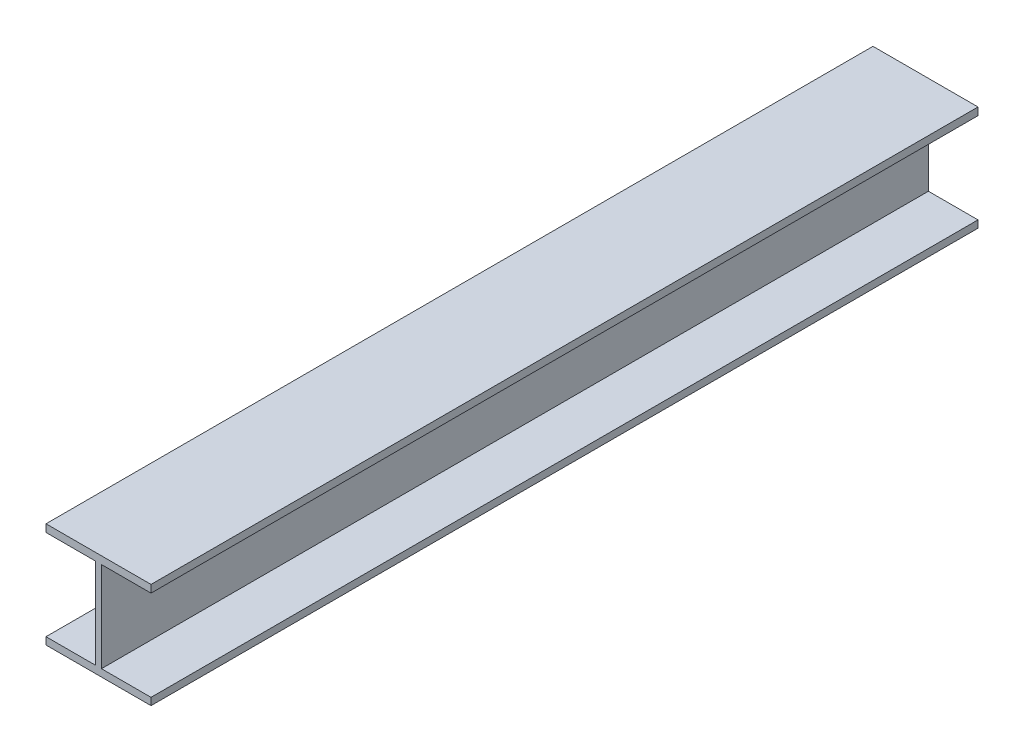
from build123d import *

# Parameters (mm, degrees)
BOSS_EXTRUDE1_DEPTH = 1000


with BuildPart() as part:
    # Sketch1 → Boss-Extrude1 (new body)
    with BuildSketch(Plane.XY):
        Polygon((63.5, 54.36), (3.555, 54.36), (3.555, -54.74), (63.5, -54.74), (63.5, -63.5), (-63.5, -63.5), (-63.5, -54.74), (-3.555, -54.74), (-3.555, 54.36), (-63.5, 54.36), (-63.5, 63.5), (63.5, 63.5), align=None)
    extrude(amount=BOSS_EXTRUDE1_DEPTH)


solid = part.part
